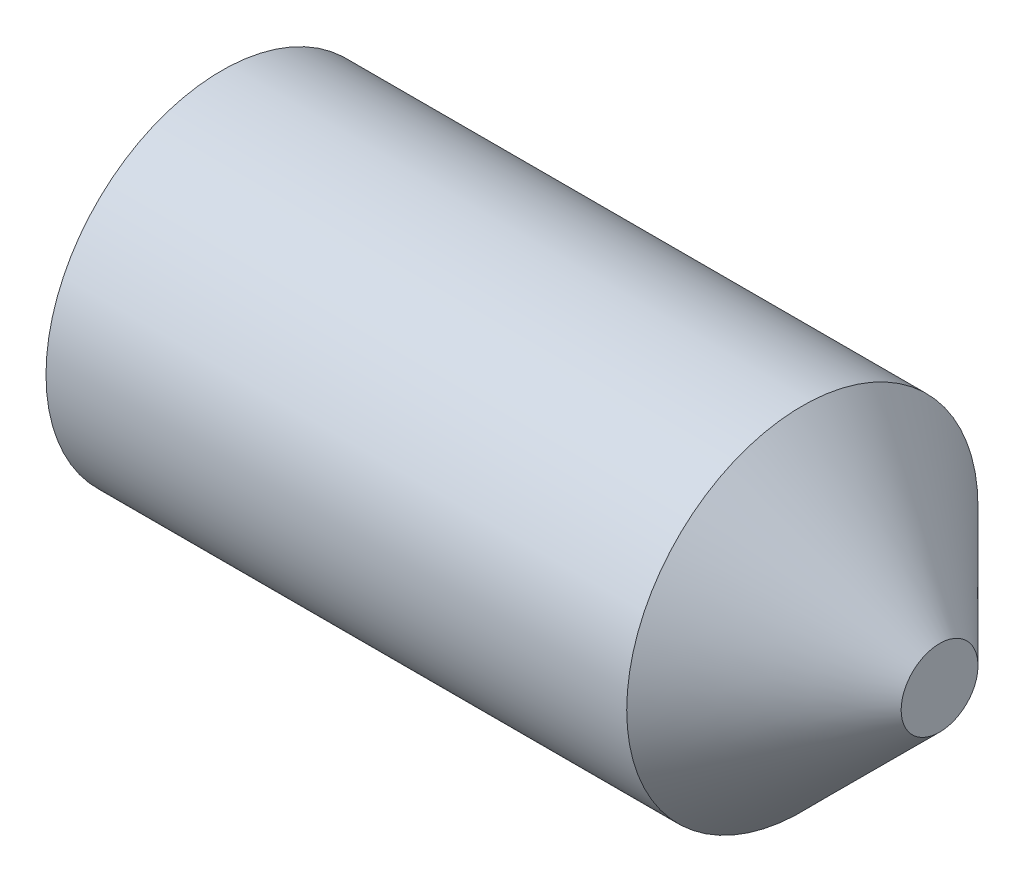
from build123d import *

# Parameters (mm, degrees)
HEX_2_DEPTH = 15


with BuildPart() as part:
    # BodySke → BaseBody (revolve)
    with BuildSketch(Plane.XY, mode=Mode.PRIVATE) as basebody_sk:
        Polygon((0, 0), (0, 10.352), (0.951473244, 12), (40.625, 12), (50, 2.625), (50, 0), align=None)
    revolve(basebody_sk.sketch.rotate(Axis((-12.7, 0, 0), (1, 0, 0)), 90), axis=Axis((-12.7, 0, 0), (1, 0, 0)))

    # Sketch2 → Hex 2 (cut)
    with BuildSketch(Plane.ZY):
        Polygon((3.464101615, 6), (-3.464101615, 6), (-6.92820323, 0), (-3.464101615, -6), (3.464101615, -6), (6.92820323, 0), align=None)
    extrude(amount=-HEX_2_DEPTH, mode=Mode.SUBTRACT)


solid = part.part
